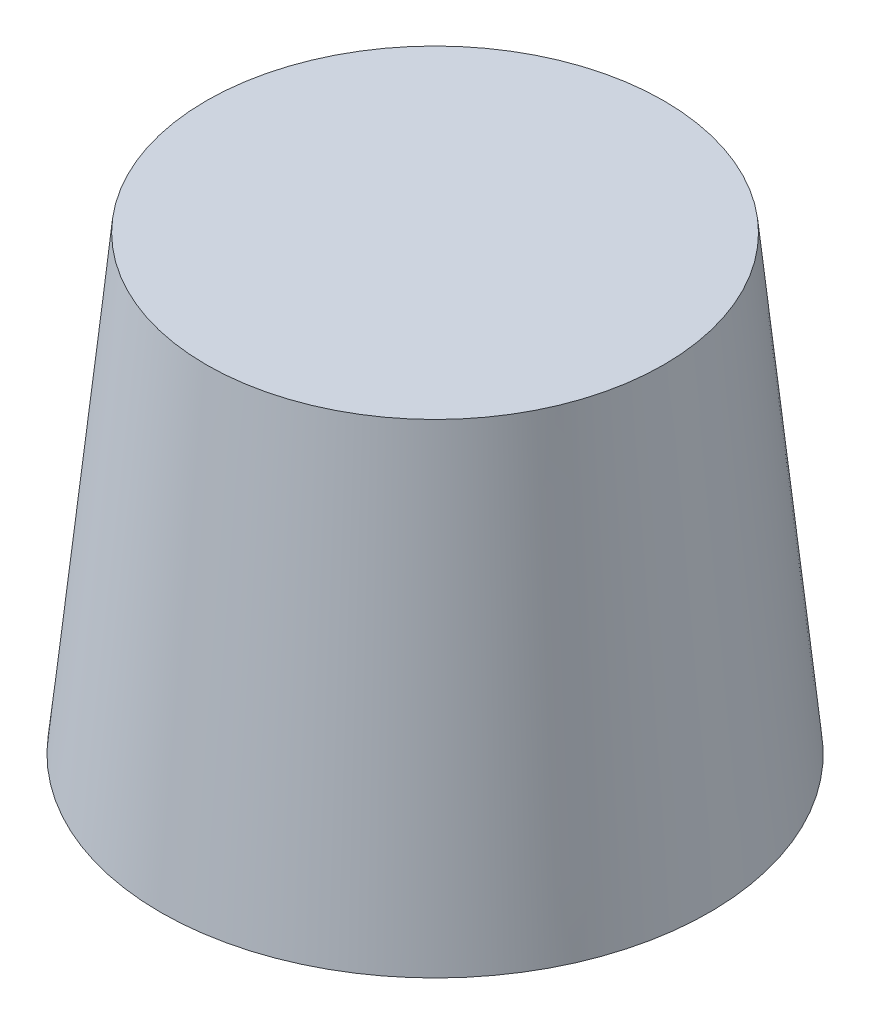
from build123d import *

# Parameters (mm, degrees)
SKETCH2_R = 75
SKETCH1_R = 90


with BuildPart() as part:
    # Sketch2 → Loft1 section 0
    with BuildSketch(Plane(origin=(0, 148, 0), x_dir=(1, 0, 0), z_dir=(0, 1, 0))):
        Circle(SKETCH2_R)
    # Sketch1 → Loft1 section 1
    with BuildSketch(Plane(origin=(0, 0, 0), x_dir=(1, 0, 0), z_dir=(0, 1, 0))):
        Circle(SKETCH1_R)
    loft()


solid = part.part
